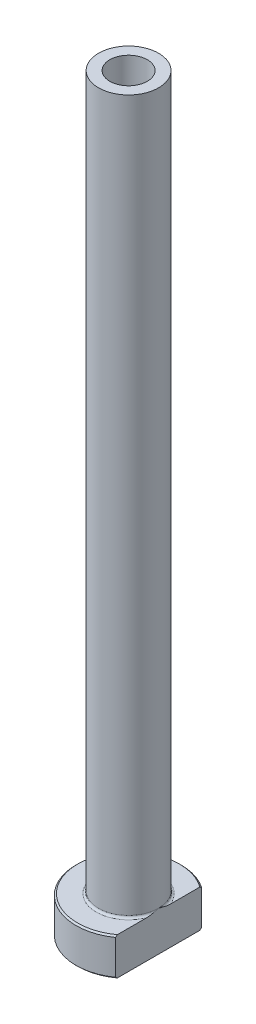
ISO-10303-21;
HEADER;
FILE_DESCRIPTION(('STEP AP214'),'2;1');
FILE_NAME('part.step','',(''),(''),'','','');
FILE_SCHEMA(('AUTOMOTIVE_DESIGN { 1 0 10303 214 1 1 1 1 }'));
ENDSEC;
DATA;
#1=APPLICATION_CONTEXT('core data for automotive mechanical design processes');
#2=APPLICATION_PROTOCOL_DEFINITION('international standard','automotive_design',2000,#1);
#3=PRODUCT_CONTEXT('',#1,'mechanical');
#4=PRODUCT('Part','Part','',(#3));
#5=PRODUCT_RELATED_PRODUCT_CATEGORY('part','',(#4));
#6=PRODUCT_DEFINITION_FORMATION('','',#4);
#7=PRODUCT_DEFINITION_CONTEXT('part definition',#1,'design');
#8=PRODUCT_DEFINITION('design','',#6,#7);
#9=PRODUCT_DEFINITION_SHAPE('','',#8);
#10=(LENGTH_UNIT() NAMED_UNIT(*) SI_UNIT(.MILLI.,.METRE.));
#11=(NAMED_UNIT(*) PLANE_ANGLE_UNIT() SI_UNIT($,.RADIAN.));
#12=(NAMED_UNIT(*) SI_UNIT($,.STERADIAN.) SOLID_ANGLE_UNIT());
#13=UNCERTAINTY_MEASURE_WITH_UNIT(LENGTH_MEASURE(1.E-05),#10,'distance_accuracy_value','');
#14=(GEOMETRIC_REPRESENTATION_CONTEXT(3) GLOBAL_UNCERTAINTY_ASSIGNED_CONTEXT((#13)) GLOBAL_UNIT_ASSIGNED_CONTEXT((#10,
#11,#12)) REPRESENTATION_CONTEXT('',''));
#15=CARTESIAN_POINT('',(0.,0.,0.));
#16=DIRECTION('',(0.,0.,1.));
#17=DIRECTION('',(1.,0.,0.));
#18=AXIS2_PLACEMENT_3D('',#15,#16,#17);
#19=CARTESIAN_POINT('',(0.,92.1876809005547,0.));
#20=DIRECTION('',(0.,1.,0.));
#21=DIRECTION('',(0.,0.,1.));
#22=AXIS2_PLACEMENT_3D('',#19,#20,#21);
#23=CYLINDRICAL_SURFACE('',#22,2.49999999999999);
#24=CARTESIAN_POINT('',(0.,100.,0.));
#25=DIRECTION('',(0.,1.,0.));
#26=DIRECTION('',(0.,0.,1.));
#27=AXIS2_PLACEMENT_3D('',#24,#25,#26);
#28=CIRCLE('',#27,2.49999999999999);
#29=CARTESIAN_POINT('',(0.,100.,2.49999999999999));
#30=VERTEX_POINT('',#29);
#31=EDGE_CURVE('E167',#30,#30,#28,.T.);
#32=ORIENTED_EDGE('',*,*,#31,.T.);
#33=EDGE_LOOP('',(#32));
#34=FACE_BOUND('',#33,.T.);
#35=CARTESIAN_POINT('',(0.,55.,0.));
#36=DIRECTION('',(0.,1.,0.));
#37=DIRECTION('',(0.,0.,1.));
#38=AXIS2_PLACEMENT_3D('',#35,#36,#37);
#39=CIRCLE('',#38,2.49999999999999);
#40=CARTESIAN_POINT('',(0.,55.,2.49999999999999));
#41=VERTEX_POINT('',#40);
#42=EDGE_CURVE('E170',#41,#41,#39,.T.);
#43=ORIENTED_EDGE('',*,*,#42,.F.);
#44=EDGE_LOOP('',(#43));
#45=FACE_BOUND('',#44,.T.);
#46=ADVANCED_FACE('F32',(#34,#45),#23,.F.);
#47=CARTESIAN_POINT('',(-2.49999999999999,100.,0.));
#48=DIRECTION('',(0.,1.,0.));
#49=DIRECTION('',(0.,0.,1.));
#50=AXIS2_PLACEMENT_3D('',#47,#48,#49);
#51=PLANE('',#50);
#52=CARTESIAN_POINT('',(0.,100.,0.));
#53=DIRECTION('',(0.,1.,0.));
#54=DIRECTION('',(0.,0.,1.));
#55=AXIS2_PLACEMENT_3D('',#52,#53,#54);
#56=CIRCLE('',#55,4.);
#57=CARTESIAN_POINT('',(0.,100.,4.));
#58=VERTEX_POINT('',#57);
#59=EDGE_CURVE('E174',#58,#58,#56,.T.);
#60=ORIENTED_EDGE('',*,*,#59,.T.);
#61=EDGE_LOOP('',(#60));
#62=FACE_BOUND('',#61,.T.);
#63=ORIENTED_EDGE('',*,*,#31,.F.);
#64=EDGE_LOOP('',(#63));
#65=FACE_BOUND('',#64,.T.);
#66=ADVANCED_FACE('F157',(#62,#65),#51,.T.);
#67=CARTESIAN_POINT('',(0.,92.1876809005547,0.));
#68=DIRECTION('',(0.,1.,0.));
#69=DIRECTION('',(0.,0.,1.));
#70=AXIS2_PLACEMENT_3D('',#67,#68,#69);
#71=CYLINDRICAL_SURFACE('',#70,4.);
#72=CARTESIAN_POINT('',(0.,5.3,0.));
#73=DIRECTION('',(0.,1.,0.));
#74=DIRECTION('',(0.,0.,1.));
#75=AXIS2_PLACEMENT_3D('',#72,#73,#74);
#76=CIRCLE('',#75,4.);
#77=CARTESIAN_POINT('',(4.,5.3,0.));
#78=VERTEX_POINT('',#77);
#79=EDGE_CURVE('E180',#78,#78,#76,.T.);
#80=ORIENTED_EDGE('',*,*,#79,.T.);
#81=EDGE_LOOP('',(#80));
#82=FACE_BOUND('',#81,.T.);
#83=ORIENTED_EDGE('',*,*,#59,.F.);
#84=EDGE_LOOP('',(#83));
#85=FACE_BOUND('',#84,.T.);
#86=ADVANCED_FACE('F162',(#82,#85),#71,.T.);
#87=CARTESIAN_POINT('',(-3.99999999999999,5.,0.));
#88=DIRECTION('',(0.,1.,0.));
#89=DIRECTION('',(0.,0.,1.));
#90=AXIS2_PLACEMENT_3D('',#87,#88,#89);
#91=PLANE('',#90);
#92=DIRECTION('',(0.,0.,1.));
#93=VECTOR('',#92,1.);
#94=CARTESIAN_POINT('',(4.,5.,0.));
#95=LINE('',#94,#93);
#96=CARTESIAN_POINT('',(4.,5.,-5.499090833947));
#97=VERTEX_POINT('',#96);
#98=CARTESIAN_POINT('',(4.,5.,-1.57797338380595));
#99=VERTEX_POINT('',#98);
#100=EDGE_CURVE('E54',#97,#99,#95,.T.);
#101=ORIENTED_EDGE('',*,*,#100,.F.);
#102=CARTESIAN_POINT('',(0.,5.,0.));
#103=DIRECTION('',(0.,1.,0.));
#104=DIRECTION('',(0.,0.,1.));
#105=AXIS2_PLACEMENT_3D('',#102,#103,#104);
#106=CIRCLE('',#105,6.79999999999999);
#107=CARTESIAN_POINT('',(3.99999999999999,5.,5.499090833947));
#108=VERTEX_POINT('',#107);
#109=EDGE_CURVE('E186',#97,#108,#106,.T.);
#110=ORIENTED_EDGE('',*,*,#109,.T.);
#111=CARTESIAN_POINT('',(4.,5.,1.57797338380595));
#112=VERTEX_POINT('',#111);
#113=EDGE_CURVE('E134',#112,#108,#95,.T.);
#114=ORIENTED_EDGE('',*,*,#113,.F.);
#115=CARTESIAN_POINT('',(0.,5.,0.));
#116=DIRECTION('',(0.,1.,0.));
#117=DIRECTION('',(0.,0.,1.));
#118=AXIS2_PLACEMENT_3D('',#115,#116,#117);
#119=CIRCLE('',#118,4.3);
#120=EDGE_CURVE('E183',#112,#99,#119,.F.);
#121=ORIENTED_EDGE('',*,*,#120,.T.);
#122=EDGE_LOOP('',(#101,#110,#114,#121));
#123=FACE_BOUND('',#122,.T.);
#124=ADVANCED_FACE('F197',(#123),#91,.T.);
#125=CARTESIAN_POINT('',(0.,92.1876809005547,0.));
#126=DIRECTION('',(0.,1.,0.));
#127=DIRECTION('',(0.,0.,1.));
#128=AXIS2_PLACEMENT_3D('',#125,#126,#127);
#129=CYLINDRICAL_SURFACE('',#128,6.99999999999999);
#130=DIRECTION('',(0.,-1.,0.));
#131=VECTOR('',#130,1.);
#132=CARTESIAN_POINT('',(3.99999999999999,100.,5.74456264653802));
#133=LINE('',#132,#131);
#134=CARTESIAN_POINT('',(3.99999999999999,4.8,5.74456264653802));
#135=VERTEX_POINT('',#134);
#136=CARTESIAN_POINT('',(3.99999999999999,0.199999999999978,5.74456264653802));
#137=VERTEX_POINT('',#136);
#138=EDGE_CURVE('E82',#135,#137,#133,.T.);
#139=ORIENTED_EDGE('',*,*,#138,.F.);
#140=CARTESIAN_POINT('',(0.,4.8,0.));
#141=DIRECTION('',(0.,1.,0.));
#142=DIRECTION('',(0.,0.,1.));
#143=AXIS2_PLACEMENT_3D('',#140,#141,#142);
#144=CIRCLE('',#143,6.99999999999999);
#145=CARTESIAN_POINT('',(4.,4.8,-5.74456264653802));
#146=VERTEX_POINT('',#145);
#147=EDGE_CURVE('E95',#135,#146,#144,.F.);
#148=ORIENTED_EDGE('',*,*,#147,.T.);
#149=DIRECTION('',(0.,-1.,0.));
#150=VECTOR('',#149,1.);
#151=CARTESIAN_POINT('',(4.,100.,-5.74456264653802));
#152=LINE('',#151,#150);
#153=CARTESIAN_POINT('',(4.,0.199999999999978,-5.74456264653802));
#154=VERTEX_POINT('',#153);
#155=EDGE_CURVE('E192',#146,#154,#152,.T.);
#156=ORIENTED_EDGE('',*,*,#155,.T.);
#157=CARTESIAN_POINT('',(0.,0.199999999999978,0.));
#158=DIRECTION('',(0.,-1.,0.));
#159=DIRECTION('',(0.,0.,-1.));
#160=AXIS2_PLACEMENT_3D('',#157,#158,#159);
#161=CIRCLE('',#160,6.99999999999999);
#162=EDGE_CURVE('E98',#154,#137,#161,.F.);
#163=ORIENTED_EDGE('',*,*,#162,.T.);
#164=EDGE_LOOP('',(#139,#148,#156,#163));
#165=FACE_BOUND('',#164,.T.);
#166=ADVANCED_FACE('F190',(#165),#129,.T.);
#167=CARTESIAN_POINT('',(-6.99999999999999,0.,0.));
#168=DIRECTION('',(0.,-1.,0.));
#169=DIRECTION('',(0.,0.,-1.));
#170=AXIS2_PLACEMENT_3D('',#167,#168,#169);
#171=PLANE('',#170);
#172=CARTESIAN_POINT('',(0.,0.,0.));
#173=DIRECTION('',(0.,-1.,0.));
#174=DIRECTION('',(0.,0.,-1.));
#175=AXIS2_PLACEMENT_3D('',#172,#173,#174);
#176=CIRCLE('',#175,3.24999999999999);
#177=CARTESIAN_POINT('',(0.,0.,-3.24999999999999));
#178=VERTEX_POINT('',#177);
#179=EDGE_CURVE('E40',#178,#178,#176,.F.);
#180=ORIENTED_EDGE('',*,*,#179,.T.);
#181=EDGE_LOOP('',(#180));
#182=FACE_BOUND('',#181,.T.);
#183=DIRECTION('',(0.,0.,-1.));
#184=VECTOR('',#183,1.);
#185=CARTESIAN_POINT('',(3.99999999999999,0.,5.74456264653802));
#186=LINE('',#185,#184);
#187=CARTESIAN_POINT('',(3.99999999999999,0.,5.49909083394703));
#188=VERTEX_POINT('',#187);
#189=CARTESIAN_POINT('',(4.,0.,-5.49909083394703));
#190=VERTEX_POINT('',#189);
#191=EDGE_CURVE('E47',#188,#190,#186,.T.);
#192=ORIENTED_EDGE('',*,*,#191,.F.);
#193=CARTESIAN_POINT('',(0.,0.,0.));
#194=DIRECTION('',(0.,-1.,0.));
#195=DIRECTION('',(0.,0.,-1.));
#196=AXIS2_PLACEMENT_3D('',#193,#194,#195);
#197=CIRCLE('',#196,6.80000000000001);
#198=EDGE_CURVE('E92',#188,#190,#197,.T.);
#199=ORIENTED_EDGE('',*,*,#198,.T.);
#200=EDGE_LOOP('',(#192,#199));
#201=FACE_BOUND('',#200,.T.);
#202=ADVANCED_FACE('F91',(#182,#201),#171,.T.);
#203=CARTESIAN_POINT('',(0.,92.1876809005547,0.));
#204=DIRECTION('',(0.,1.,0.));
#205=DIRECTION('',(0.,0.,1.));
#206=AXIS2_PLACEMENT_3D('',#203,#204,#205);
#207=CYLINDRICAL_SURFACE('',#206,2.74999999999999);
#208=CARTESIAN_POINT('',(0.,0.5,0.));
#209=DIRECTION('',(0.,-1.,0.));
#210=DIRECTION('',(0.,0.,-1.));
#211=AXIS2_PLACEMENT_3D('',#208,#209,#210);
#212=CIRCLE('',#211,2.74999999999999);
#213=CARTESIAN_POINT('',(0.,0.5,-2.74999999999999));
#214=VERTEX_POINT('',#213);
#215=EDGE_CURVE('E11',#214,#214,#212,.T.);
#216=ORIENTED_EDGE('',*,*,#215,.T.);
#217=EDGE_LOOP('',(#216));
#218=FACE_BOUND('',#217,.T.);
#219=CARTESIAN_POINT('',(0.,43.,0.));
#220=DIRECTION('',(0.,1.,0.));
#221=DIRECTION('',(0.,0.,1.));
#222=AXIS2_PLACEMENT_3D('',#219,#220,#221);
#223=CIRCLE('',#222,2.75);
#224=CARTESIAN_POINT('',(0.,43.,2.75));
#225=VERTEX_POINT('',#224);
#226=EDGE_CURVE('E172',#225,#225,#223,.T.);
#227=ORIENTED_EDGE('',*,*,#226,.T.);
#228=EDGE_LOOP('',(#227));
#229=FACE_BOUND('',#228,.T.);
#230=ADVANCED_FACE('F215',(#218,#229),#207,.F.);
#231=CARTESIAN_POINT('',(0.,43.,0.));
#232=DIRECTION('',(0.,-1.,0.));
#233=DIRECTION('',(0.,0.,-1.));
#234=AXIS2_PLACEMENT_3D('',#231,#232,#233);
#235=CONICAL_SURFACE('',#234,2.75,0.0208303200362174);
#236=ORIENTED_EDGE('',*,*,#42,.T.);
#237=EDGE_LOOP('',(#236));
#238=FACE_BOUND('',#237,.T.);
#239=ORIENTED_EDGE('',*,*,#226,.F.);
#240=EDGE_LOOP('',(#239));
#241=FACE_BOUND('',#240,.T.);
#242=ADVANCED_FACE('F111',(#238,#241),#235,.F.);
#243=CARTESIAN_POINT('',(0.,5.3,0.));
#244=DIRECTION('',(0.,1.,0.));
#245=DIRECTION('',(0.,0.,1.));
#246=AXIS2_PLACEMENT_3D('',#243,#244,#245);
#247=TOROIDAL_SURFACE('',#246,4.3,0.3);
#248=ORIENTED_EDGE('',*,*,#120,.F.);
#249=CARTESIAN_POINT('',(4.,5.3,0.));
#250=CARTESIAN_POINT('',(4.,5.30000062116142,-1.06250722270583E-10));
#251=CARTESIAN_POINT('',(4.,5.30000124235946,2.17726018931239E-07));
#252=CARTESIAN_POINT('',(4.,5.30000240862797,8.3614089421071E-07));
#253=CARTESIAN_POINT('',(4.,5.30000294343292,1.25011668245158E-06));
#254=CARTESIAN_POINT('',(4.,5.30000404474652,2.2395931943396E-06));
#255=CARTESIAN_POINT('',(4.,5.30000459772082,2.83084440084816E-06));
#256=CARTESIAN_POINT('',(4.,5.30000559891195,4.06516578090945E-06));
#257=CARTESIAN_POINT('',(4.,5.30000604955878,4.70640059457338E-06));
#258=CARTESIAN_POINT('',(4.,5.30000769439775,7.15677166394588E-06));
#259=CARTESIAN_POINT('',(4.,5.30000879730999,9.02995921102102E-06));
#260=CARTESIAN_POINT('',(4.,5.30001063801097,1.27664881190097E-05));
#261=CARTESIAN_POINT('',(4.,5.30001139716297,1.46197801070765E-05));
#262=CARTESIAN_POINT('',(4.,5.30001453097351,2.23679212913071E-05));
#263=CARTESIAN_POINT('',(4.,5.30001683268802,2.82968736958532E-05));
#264=CARTESIAN_POINT('',(4.,5.30002027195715,3.95668715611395E-05));
#265=CARTESIAN_POINT('',(4.,5.30002152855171,4.48715448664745E-05));
#266=CARTESIAN_POINT('',(4.,5.30003060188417,8.40118178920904E-05));
#267=CARTESIAN_POINT('',(4.,5.30003739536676,0.000118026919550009));
#268=CARTESIAN_POINT('',(4.,5.30006713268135,0.000252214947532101));
#269=CARTESIAN_POINT('',(4.,5.30009559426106,0.000351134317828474));
#270=CARTESIAN_POINT('',(4.,5.3002062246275,0.00074247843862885));
#271=CARTESIAN_POINT('',(4.,5.30028475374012,0.00103561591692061));
#272=CARTESIAN_POINT('',(4.,5.30059889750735,0.0021992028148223));
#273=CARTESIAN_POINT('',(4.,5.30083905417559,0.00306873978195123));
#274=CARTESIAN_POINT('',(4.,5.3018368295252,0.00669141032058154));
#275=CARTESIAN_POINT('',(4.,5.30258877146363,0.00944568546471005));
#276=CARTESIAN_POINT('',(4.,5.31066890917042,0.039029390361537));
#277=CARTESIAN_POINT('',(4.,5.31802631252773,0.0658531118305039));
#278=CARTESIAN_POINT('',(4.,5.33239676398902,0.118441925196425));
#279=CARTESIAN_POINT('',(4.,5.33941183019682,0.144206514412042));
#280=CARTESIAN_POINT('',(4.,5.35427366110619,0.199017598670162));
#281=CARTESIAN_POINT('',(4.,5.36211313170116,0.228066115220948));
#282=CARTESIAN_POINT('',(4.,5.37776349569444,0.286511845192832));
#283=CARTESIAN_POINT('',(4.,5.38557313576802,0.31590939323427));
#284=CARTESIAN_POINT('',(4.,5.40425662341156,0.386994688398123));
#285=CARTESIAN_POINT('',(4.,5.41505237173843,0.428703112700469));
#286=CARTESIAN_POINT('',(4.,5.43592310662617,0.511098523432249));
#287=CARTESIAN_POINT('',(4.,5.44600969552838,0.551782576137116));
#288=CARTESIAN_POINT('',(4.,5.4785098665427,0.686599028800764));
#289=CARTESIAN_POINT('',(4.,5.4997837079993,0.781011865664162));
#290=CARTESIAN_POINT('',(4.,5.53807543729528,0.971847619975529));
#291=CARTESIAN_POINT('',(4.,5.55504273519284,1.06828120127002));
#292=CARTESIAN_POINT('',(4.,5.57582405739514,1.21752725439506));
#293=CARTESIAN_POINT('',(4.,5.58209796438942,1.26999379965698));
#294=CARTESIAN_POINT('',(4.,5.59210686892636,1.37516324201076));
#295=CARTESIAN_POINT('',(4.,5.59584265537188,1.42786606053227));
#296=CARTESIAN_POINT('',(4.,5.60010438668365,1.53310673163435));
#297=CARTESIAN_POINT('',(4.,5.6006487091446,1.5856437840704));
#298=CARTESIAN_POINT('',(4.,5.59767158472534,1.69058605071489));
#299=CARTESIAN_POINT('',(4.,5.59415502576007,1.74299134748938));
#300=CARTESIAN_POINT('',(4.,5.58503062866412,1.81903290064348));
#301=CARTESIAN_POINT('',(4.,5.58157617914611,1.84292934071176));
#302=CARTESIAN_POINT('',(4.,5.57329952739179,1.89051061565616));
#303=CARTESIAN_POINT('',(4.,5.56847619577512,1.91419525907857));
#304=CARTESIAN_POINT('',(4.,5.55726644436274,1.96092888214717));
#305=CARTESIAN_POINT('',(4.,5.55089740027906,1.98398195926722));
#306=CARTESIAN_POINT('',(4.,5.53623434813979,2.02945550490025));
#307=CARTESIAN_POINT('',(4.,5.52794253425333,2.05187666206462));
#308=CARTESIAN_POINT('',(4.,5.50887098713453,2.09590631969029));
#309=CARTESIAN_POINT('',(4.,5.49806837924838,2.11750508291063));
#310=CARTESIAN_POINT('',(4.,5.47333401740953,2.15885583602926));
#311=CARTESIAN_POINT('',(4.,5.45941272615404,2.17861369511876));
#312=CARTESIAN_POINT('',(4.,5.43588221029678,2.20522942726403));
#313=CARTESIAN_POINT('',(4.,5.42781139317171,2.2134404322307));
#314=CARTESIAN_POINT('',(4.,5.41065114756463,2.2287514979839));
#315=CARTESIAN_POINT('',(4.,5.40156129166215,2.23585108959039));
#316=CARTESIAN_POINT('',(4.,5.38220524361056,2.2485969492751));
#317=CARTESIAN_POINT('',(4.,5.37192420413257,2.25422119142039));
#318=CARTESIAN_POINT('',(4.,5.35045072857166,2.2633106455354));
#319=CARTESIAN_POINT('',(4.,5.33926122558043,2.26678251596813));
#320=CARTESIAN_POINT('',(4.,5.31952044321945,2.27051268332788));
#321=CARTESIAN_POINT('',(4.,5.3110845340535,2.27139016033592));
#322=CARTESIAN_POINT('',(4.,5.29418624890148,2.2716896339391));
#323=CARTESIAN_POINT('',(4.,5.28572387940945,2.27111196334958));
#324=CARTESIAN_POINT('',(4.,5.26904138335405,2.26855580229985));
#325=CARTESIAN_POINT('',(4.,5.26082066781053,2.26658107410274));
#326=CARTESIAN_POINT('',(4.,5.24478214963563,2.26139496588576));
#327=CARTESIAN_POINT('',(4.,5.23696461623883,2.25818277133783));
#328=CARTESIAN_POINT('',(4.,5.21851235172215,2.24908332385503));
#329=CARTESIAN_POINT('',(4.,5.20815219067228,2.24264095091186));
#330=CARTESIAN_POINT('',(4.,5.18857975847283,2.22819957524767));
#331=CARTESIAN_POINT('',(4.,5.17937061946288,2.2201964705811));
#332=CARTESIAN_POINT('',(4.,5.15665383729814,2.19777756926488));
#333=CARTESIAN_POINT('',(4.,5.14403484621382,2.18246908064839));
#334=CARTESIAN_POINT('',(4.,5.12118369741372,2.15020843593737));
#335=CARTESIAN_POINT('',(4.,5.11095480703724,2.13325407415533));
#336=CARTESIAN_POINT('',(4.,5.09273574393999,2.09892324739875));
#337=CARTESIAN_POINT('',(4.,5.08468212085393,2.08157988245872));
#338=CARTESIAN_POINT('',(4.,5.07005901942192,2.04627072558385));
#339=CARTESIAN_POINT('',(4.,5.06349101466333,2.02830433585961));
#340=CARTESIAN_POINT('',(4.,5.04555485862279,1.97350761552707));
#341=CARTESIAN_POINT('',(4.,5.03608974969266,1.93605770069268));
#342=CARTESIAN_POINT('',(4.,5.01780569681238,1.84529235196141));
#343=CARTESIAN_POINT('',(4.,5.01077018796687,1.79164082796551));
#344=CARTESIAN_POINT('',(4.,5.00182846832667,1.68379947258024));
#345=CARTESIAN_POINT('',(4.,4.99993887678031,1.62960846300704));
#346=CARTESIAN_POINT('',(4.,5.00006129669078,1.52361204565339));
#347=CARTESIAN_POINT('',(4.,5.0019069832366,1.47180551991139));
#348=CARTESIAN_POINT('',(4.,5.0084124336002,1.36835357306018));
#349=CARTESIAN_POINT('',(4.,5.01307376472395,1.31670825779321));
#350=CARTESIAN_POINT('',(4.,5.02905484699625,1.17431887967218));
#351=CARTESIAN_POINT('',(4.,5.04274090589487,1.08384207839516));
#352=CARTESIAN_POINT('',(4.,5.06701714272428,0.947757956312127));
#353=CARTESIAN_POINT('',(4.,5.07585573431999,0.901814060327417));
#354=CARTESIAN_POINT('',(4.,5.09458665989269,0.810008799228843));
#355=CARTESIAN_POINT('',(4.,5.1044818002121,0.764148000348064));
#356=CARTESIAN_POINT('',(4.,5.12892434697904,0.655631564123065));
#357=CARTESIAN_POINT('',(4.,5.14383556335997,0.593058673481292));
#358=CARTESIAN_POINT('',(4.,5.17458762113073,0.468885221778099));
#359=CARTESIAN_POINT('',(4.,5.19041623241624,0.407281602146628));
#360=CARTESIAN_POINT('',(4.,5.22090834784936,0.29123270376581));
#361=CARTESIAN_POINT('',(4.,5.23550024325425,0.236768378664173));
#362=CARTESIAN_POINT('',(4.,5.26562550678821,0.125604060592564));
#363=CARTESIAN_POINT('',(4.,5.28117250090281,0.0689076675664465));
#364=CARTESIAN_POINT('',(4.,5.29741226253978,0.0094415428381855));
#365=CARTESIAN_POINT('',(4.,5.29816540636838,0.00668315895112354));
#366=CARTESIAN_POINT('',(4.,5.29916346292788,0.00305954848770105));
#367=CARTESIAN_POINT('',(4.,5.29940273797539,0.00219318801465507));
#368=CARTESIAN_POINT('',(4.,5.2997158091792,0.00103357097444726));
#369=CARTESIAN_POINT('',(4.,5.29979412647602,0.00074122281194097));
#370=CARTESIAN_POINT('',(4.,5.29990450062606,0.000350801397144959));
#371=CARTESIAN_POINT('',(4.,5.29993292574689,0.000252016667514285));
#372=CARTESIAN_POINT('',(4.,5.29996263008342,0.000117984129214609));
#373=CARTESIAN_POINT('',(4.,5.29996941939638,8.39881862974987E-05));
#374=CARTESIAN_POINT('',(4.,5.29997848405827,4.48673992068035E-05));
#375=CARTESIAN_POINT('',(4.,5.29997973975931,3.95638164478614E-05));
#376=CARTESIAN_POINT('',(4.,5.29998317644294,2.8296031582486E-05));
#377=CARTESIAN_POINT('',(4.,5.2999854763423,2.23681438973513E-05));
#378=CARTESIAN_POINT('',(4.,5.29998860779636,1.46210990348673E-05));
#379=CARTESIAN_POINT('',(4.,5.29998936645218,1.27678887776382E-05));
#380=CARTESIAN_POINT('',(4.,5.29999120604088,9.03143944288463E-06));
#381=CARTESIAN_POINT('',(4.,5.29999230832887,7.15824000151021E-06));
#382=CARTESIAN_POINT('',(4.,5.29999395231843,4.70775467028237E-06));
#383=CARTESIAN_POINT('',(4.,5.29999440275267,4.06646329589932E-06));
#384=CARTESIAN_POINT('',(4.,5.29999540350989,2.83199042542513E-06));
#385=CARTESIAN_POINT('',(4.,5.29999595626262,2.24064306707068E-06));
#386=CARTESIAN_POINT('',(4.,5.29999705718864,1.25093947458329E-06));
#387=CARTESIAN_POINT('',(4.,5.2999975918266,8.36840866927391E-07));
#388=CARTESIAN_POINT('',(4.,5.29999875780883,2.18117657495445E-07));
#389=CARTESIAN_POINT('',(4.,5.29999937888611,1.06243800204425E-10));
#390=CARTESIAN_POINT('',(4.,5.3,0.));
#391=B_SPLINE_CURVE_WITH_KNOTS('',3,(#249,#250,#251,#252,#253,#254,#255,#256,#257,#258,#259,
#260,#261,#262,#263,#264,#265,#266,#267,#268,#269,#270,#271,#272,#273,#274,#275,#276,#277,#278,
#279,#280,#281,#282,#283,#284,#285,#286,#287,#288,#289,#290,#291,#292,#293,#294,#295,#296,#297,
#298,#299,#300,#301,#302,#303,#304,#305,#306,#307,#308,#309,#310,#311,#312,#313,#314,#315,#316,
#317,#318,#319,#320,#321,#322,#323,#324,#325,#326,#327,#328,#329,#330,#331,#332,#333,#334,#335,
#336,#337,#338,#339,#340,#341,#342,#343,#344,#345,#346,#347,#348,#349,#350,#351,#352,#353,#354,
#355,#356,#357,#358,#359,#360,#361,#362,#363,#364,#365,#366,#367,#368,#369,#370,#371,#372,#373,
#374,#375,#376,#377,#378,#379,#380,#381,#382,#383,#384,#385,#386,#387,#388,#389,#390),
.UNSPECIFIED.,.T.,.F.,(4,2,2,2,2,2,2,2,2,2,2,2,2,2,2,2,2,2,2,2,2,2,2,2,2,2,2,2,2,2,2,2,2,2,2,2,
2,2,2,2,2,2,2,2,2,2,2,2,2,2,2,2,2,2,2,2,2,2,2,2,2,2,2,2,2,2,2,2,2,2,4),(0.,1.87484528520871E-06,
3.90180232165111E-06,6.31684114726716E-06,8.6665232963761E-06,1.51627596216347E-05,
2.11657986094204E-05,4.02090827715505E-05,5.65429538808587E-05,0.00016062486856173,
0.000469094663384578,0.001379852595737,0.00408571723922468,0.0126514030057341,
0.0960918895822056,0.176200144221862,0.266463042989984,0.357714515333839,0.486961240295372,
0.612707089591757,0.902988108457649,1.19653589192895,1.35501075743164,1.51343634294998,
1.67094875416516,1.82827177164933,1.90067591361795,1.97313996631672,2.04482437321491,
2.11642737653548,2.18871023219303,2.26075412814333,2.29521947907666,2.32969934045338,
2.36466792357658,2.39952778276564,2.42485422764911,2.45017488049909,2.47542760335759,
2.50069697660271,2.53708899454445,2.57357798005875,2.63276032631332,2.6920231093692,
2.749303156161,2.80663977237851,2.92223125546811,3.08420752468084,3.24670629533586,
3.40212850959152,3.55763731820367,3.83192962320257,3.97228382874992,4.11302057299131,
4.30598130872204,4.49678885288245,4.66594443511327,4.84230602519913,4.85088453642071,
4.8535805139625,4.8544888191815,4.85479687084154,4.85490089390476,4.85491722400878,
4.85493626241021,4.85494226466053,4.85494875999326,4.85495110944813,4.85495352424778,
4.85495555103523,4.85495742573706),.UNSPECIFIED.);
#392=EDGE_CURVE('E126',#112,#78,#391,.T.);
#393=ORIENTED_EDGE('',*,*,#392,.T.);
#394=ORIENTED_EDGE('',*,*,#79,.F.);
#395=CARTESIAN_POINT('',(4.,5.3,0.));
#396=CARTESIAN_POINT('',(4.,5.29999937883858,1.06251755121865E-10));
#397=CARTESIAN_POINT('',(4.,5.29999875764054,-2.17726017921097E-07));
#398=CARTESIAN_POINT('',(4.,5.29999759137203,-8.36140893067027E-07));
#399=CARTESIAN_POINT('',(4.,5.29999705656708,-1.25011668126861E-06));
#400=CARTESIAN_POINT('',(4.,5.29999595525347,-2.23959319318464E-06));
#401=CARTESIAN_POINT('',(4.,5.29999540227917,-2.83084439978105E-06));
#402=CARTESIAN_POINT('',(4.,5.29999440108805,-4.06516577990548E-06));
#403=CARTESIAN_POINT('',(4.,5.29999395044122,-4.706400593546E-06));
#404=CARTESIAN_POINT('',(4.,5.29999230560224,-7.15677166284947E-06));
#405=CARTESIAN_POINT('',(3.99999999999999,5.29999120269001,-9.02995920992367E-06));
#406=CARTESIAN_POINT('',(3.99999999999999,5.29998936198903,-1.2766488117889E-05));
#407=CARTESIAN_POINT('',(4.,5.29998860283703,-1.46197801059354E-05));
#408=CARTESIAN_POINT('',(4.,5.29998546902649,-2.23679212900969E-05));
#409=CARTESIAN_POINT('',(4.,5.29998316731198,-2.82968736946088E-05));
#410=CARTESIAN_POINT('',(4.,5.29997972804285,-3.95668715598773E-05));
#411=CARTESIAN_POINT('',(4.,5.29997847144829,-4.48715448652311E-05));
#412=CARTESIAN_POINT('',(4.,5.29996939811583,-8.40118178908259E-05));
#413=CARTESIAN_POINT('',(4.,5.29996260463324,-0.000118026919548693));
#414=CARTESIAN_POINT('',(3.99999999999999,5.29993286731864,-0.000252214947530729));
#415=CARTESIAN_POINT('',(4.,5.29990440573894,-0.000351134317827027));
#416=CARTESIAN_POINT('',(4.,5.2997937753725,-0.000742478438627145));
#417=CARTESIAN_POINT('',(4.,5.29971524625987,-0.00103561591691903));
#418=CARTESIAN_POINT('',(3.99999999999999,5.29940110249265,-0.00219920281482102));
#419=CARTESIAN_POINT('',(3.99999999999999,5.29916094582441,-0.00306873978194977));
#420=CARTESIAN_POINT('',(4.,5.2981631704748,-0.00669141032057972));
#421=CARTESIAN_POINT('',(4.,5.29741122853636,-0.0094456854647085));
#422=CARTESIAN_POINT('',(3.99999999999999,5.28933109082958,-0.039029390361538));
#423=CARTESIAN_POINT('',(3.99999999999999,5.28197368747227,-0.0658531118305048));
#424=CARTESIAN_POINT('',(4.,5.26760323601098,-0.118441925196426));
#425=CARTESIAN_POINT('',(4.,5.26058816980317,-0.144206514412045));
#426=CARTESIAN_POINT('',(3.99999999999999,5.24572633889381,-0.199017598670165));
#427=CARTESIAN_POINT('',(4.,5.23788686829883,-0.22806611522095));
#428=CARTESIAN_POINT('',(4.,5.22223650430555,-0.286511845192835));
#429=CARTESIAN_POINT('',(4.,5.21442686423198,-0.315909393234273));
#430=CARTESIAN_POINT('',(4.,5.19574337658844,-0.386994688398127));
#431=CARTESIAN_POINT('',(4.,5.18494762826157,-0.428703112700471));
#432=CARTESIAN_POINT('',(4.,5.16407689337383,-0.511098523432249));
#433=CARTESIAN_POINT('',(4.,5.15399030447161,-0.551782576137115));
#434=CARTESIAN_POINT('',(4.,5.12149013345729,-0.686599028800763));
#435=CARTESIAN_POINT('',(4.,5.1002162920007,-0.781011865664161));
#436=CARTESIAN_POINT('',(4.,5.06192456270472,-0.971847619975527));
#437=CARTESIAN_POINT('',(4.,5.04495726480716,-1.06828120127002));
#438=CARTESIAN_POINT('',(4.,5.02417594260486,-1.21752725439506));
#439=CARTESIAN_POINT('',(4.,5.01790203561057,-1.26999379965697));
#440=CARTESIAN_POINT('',(4.,5.00789313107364,-1.37516324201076));
#441=CARTESIAN_POINT('',(4.,5.00415734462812,-1.42786606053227));
#442=CARTESIAN_POINT('',(4.,4.99989561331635,-1.53310673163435));
#443=CARTESIAN_POINT('',(4.,4.9993512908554,-1.5856437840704));
#444=CARTESIAN_POINT('',(4.,5.00232841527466,-1.69058605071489));
#445=CARTESIAN_POINT('',(4.,5.00584497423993,-1.74299134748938));
#446=CARTESIAN_POINT('',(4.,5.01496937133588,-1.81903290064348));
#447=CARTESIAN_POINT('',(4.,5.01842382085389,-1.84292934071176));
#448=CARTESIAN_POINT('',(4.,5.02670047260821,-1.89051061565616));
#449=CARTESIAN_POINT('',(4.,5.03152380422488,-1.91419525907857));
#450=CARTESIAN_POINT('',(4.,5.04273355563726,-1.96092888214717));
#451=CARTESIAN_POINT('',(4.,5.04910259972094,-1.98398195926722));
#452=CARTESIAN_POINT('',(4.,5.0637656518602,-2.02945550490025));
#453=CARTESIAN_POINT('',(4.,5.07205746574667,-2.05187666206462));
#454=CARTESIAN_POINT('',(4.,5.09112901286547,-2.09590631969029));
#455=CARTESIAN_POINT('',(4.,5.10193162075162,-2.11750508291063));
#456=CARTESIAN_POINT('',(4.,5.12666598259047,-2.15885583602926));
#457=CARTESIAN_POINT('',(4.,5.14058727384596,-2.17861369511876));
#458=CARTESIAN_POINT('',(4.,5.16411778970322,-2.20522942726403));
#459=CARTESIAN_POINT('',(4.,5.17218860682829,-2.2134404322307));
#460=CARTESIAN_POINT('',(4.,5.18934885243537,-2.2287514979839));
#461=CARTESIAN_POINT('',(4.,5.19843870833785,-2.23585108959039));
#462=CARTESIAN_POINT('',(4.,5.21779475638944,-2.2485969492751));
#463=CARTESIAN_POINT('',(4.,5.22807579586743,-2.25422119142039));
#464=CARTESIAN_POINT('',(4.,5.24954927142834,-2.2633106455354));
#465=CARTESIAN_POINT('',(4.,5.26073877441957,-2.26678251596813));
#466=CARTESIAN_POINT('',(4.,5.28047955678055,-2.27051268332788));
#467=CARTESIAN_POINT('',(4.,5.2889154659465,-2.27139016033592));
#468=CARTESIAN_POINT('',(4.,5.30581375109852,-2.2716896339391));
#469=CARTESIAN_POINT('',(4.,5.31427612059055,-2.27111196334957));
#470=CARTESIAN_POINT('',(4.,5.33095861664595,-2.26855580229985));
#471=CARTESIAN_POINT('',(4.,5.33917933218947,-2.26658107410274));
#472=CARTESIAN_POINT('',(4.,5.35521785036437,-2.26139496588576));
#473=CARTESIAN_POINT('',(4.,5.36303538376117,-2.25818277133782));
#474=CARTESIAN_POINT('',(4.,5.38148764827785,-2.24908332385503));
#475=CARTESIAN_POINT('',(4.,5.39184780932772,-2.24264095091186));
#476=CARTESIAN_POINT('',(4.,5.41142024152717,-2.22819957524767));
#477=CARTESIAN_POINT('',(4.,5.42062938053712,-2.2201964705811));
#478=CARTESIAN_POINT('',(4.,5.44334616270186,-2.19777756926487));
#479=CARTESIAN_POINT('',(4.,5.45596515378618,-2.18246908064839));
#480=CARTESIAN_POINT('',(4.,5.47881630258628,-2.15020843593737));
#481=CARTESIAN_POINT('',(4.,5.48904519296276,-2.13325407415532));
#482=CARTESIAN_POINT('',(4.,5.50726425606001,-2.09892324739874));
#483=CARTESIAN_POINT('',(4.,5.51531787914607,-2.08157988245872));
#484=CARTESIAN_POINT('',(4.,5.52994098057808,-2.04627072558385));
#485=CARTESIAN_POINT('',(4.,5.53650898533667,-2.02830433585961));
#486=CARTESIAN_POINT('',(4.,5.55444514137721,-1.97350761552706));
#487=CARTESIAN_POINT('',(4.,5.56391025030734,-1.93605770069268));
#488=CARTESIAN_POINT('',(4.,5.58219430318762,-1.8452923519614));
#489=CARTESIAN_POINT('',(4.,5.58922981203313,-1.79164082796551));
#490=CARTESIAN_POINT('',(4.,5.59817153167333,-1.68379947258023));
#491=CARTESIAN_POINT('',(4.,5.60006112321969,-1.62960846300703));
#492=CARTESIAN_POINT('',(4.,5.59993870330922,-1.52361204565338));
#493=CARTESIAN_POINT('',(4.,5.5980930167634,-1.47180551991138));
#494=CARTESIAN_POINT('',(4.,5.5915875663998,-1.36835357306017));
#495=CARTESIAN_POINT('',(4.,5.58692623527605,-1.31670825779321));
#496=CARTESIAN_POINT('',(4.,5.57094515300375,-1.17431887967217));
#497=CARTESIAN_POINT('',(4.,5.55725909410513,-1.08384207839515));
#498=CARTESIAN_POINT('',(4.,5.53298285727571,-0.947757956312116));
#499=CARTESIAN_POINT('',(4.,5.52414426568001,-0.901814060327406));
#500=CARTESIAN_POINT('',(4.,5.5054133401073,-0.810008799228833));
#501=CARTESIAN_POINT('',(4.,5.4955181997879,-0.764148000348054));
#502=CARTESIAN_POINT('',(4.,5.47107565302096,-0.655631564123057));
#503=CARTESIAN_POINT('',(4.,5.45616443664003,-0.593058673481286));
#504=CARTESIAN_POINT('',(4.,5.42541237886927,-0.468885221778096));
#505=CARTESIAN_POINT('',(3.99999999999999,5.40958376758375,-0.407281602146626));
#506=CARTESIAN_POINT('',(4.,5.37909165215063,-0.291232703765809));
#507=CARTESIAN_POINT('',(4.,5.36449975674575,-0.236768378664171));
#508=CARTESIAN_POINT('',(3.99999999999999,5.33437449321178,-0.125604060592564));
#509=CARTESIAN_POINT('',(3.99999999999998,5.31882749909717,-0.0689076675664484));
#510=CARTESIAN_POINT('',(4.,5.30258773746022,-0.00944154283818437));
#511=CARTESIAN_POINT('',(4.,5.30183459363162,-0.00668315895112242));
#512=CARTESIAN_POINT('',(3.99999999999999,5.30083653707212,-0.00305954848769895));
#513=CARTESIAN_POINT('',(3.99999999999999,5.30059726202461,-0.00219318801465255));
#514=CARTESIAN_POINT('',(4.,5.30028419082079,-0.00103357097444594));
#515=CARTESIAN_POINT('',(4.,5.30020587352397,-0.000741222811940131));
#516=CARTESIAN_POINT('',(4.,5.30009549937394,-0.000350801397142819));
#517=CARTESIAN_POINT('',(3.99999999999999,5.30006707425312,-0.000252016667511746));
#518=CARTESIAN_POINT('',(4.,5.30003736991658,-0.000117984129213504));
#519=CARTESIAN_POINT('',(4.,5.30003058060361,-8.39881862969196E-05));
#520=CARTESIAN_POINT('',(4.,5.30002151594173,-4.48673992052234E-05));
#521=CARTESIAN_POINT('',(4.,5.30002026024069,-3.95638164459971E-05));
#522=CARTESIAN_POINT('',(4.,5.30001682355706,-2.82960315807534E-05));
#523=CARTESIAN_POINT('',(4.,5.3000145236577,-2.23681438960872E-05));
#524=CARTESIAN_POINT('',(4.,5.30001139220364,-1.46210990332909E-05));
#525=CARTESIAN_POINT('',(3.99999999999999,5.30001063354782,-1.27678887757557E-05));
#526=CARTESIAN_POINT('',(3.99999999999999,5.30000879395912,-9.03143944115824E-06));
#527=CARTESIAN_POINT('',(4.,5.30000769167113,-7.15824000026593E-06));
#528=CARTESIAN_POINT('',(4.,5.30000604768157,-4.70775466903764E-06));
#529=CARTESIAN_POINT('',(4.,5.30000559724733,-4.0664632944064E-06));
#530=CARTESIAN_POINT('',(4.,5.30000459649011,-2.83199042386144E-06));
#531=CARTESIAN_POINT('',(4.,5.30000404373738,-2.24064306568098E-06));
#532=CARTESIAN_POINT('',(4.,5.30000294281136,-1.25093947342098E-06));
#533=CARTESIAN_POINT('',(4.,5.30000240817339,-8.36840865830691E-07));
#534=CARTESIAN_POINT('',(4.,5.30000124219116,-2.18117656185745E-07));
#535=CARTESIAN_POINT('',(4.,5.30000062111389,-1.06242417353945E-10));
#536=CARTESIAN_POINT('',(4.,5.3,0.));
#537=B_SPLINE_CURVE_WITH_KNOTS('',3,(#395,#396,#397,#398,#399,#400,#401,#402,#403,#404,#405,
#406,#407,#408,#409,#410,#411,#412,#413,#414,#415,#416,#417,#418,#419,#420,#421,#422,#423,#424,
#425,#426,#427,#428,#429,#430,#431,#432,#433,#434,#435,#436,#437,#438,#439,#440,#441,#442,#443,
#444,#445,#446,#447,#448,#449,#450,#451,#452,#453,#454,#455,#456,#457,#458,#459,#460,#461,#462,
#463,#464,#465,#466,#467,#468,#469,#470,#471,#472,#473,#474,#475,#476,#477,#478,#479,#480,#481,
#482,#483,#484,#485,#486,#487,#488,#489,#490,#491,#492,#493,#494,#495,#496,#497,#498,#499,#500,
#501,#502,#503,#504,#505,#506,#507,#508,#509,#510,#511,#512,#513,#514,#515,#516,#517,#518,#519,
#520,#521,#522,#523,#524,#525,#526,#527,#528,#529,#530,#531,#532,#533,#534,#535,#536),
.UNSPECIFIED.,.T.,.F.,(4,2,2,2,2,2,2,2,2,2,2,2,2,2,2,2,2,2,2,2,2,2,2,2,2,2,2,2,2,2,2,2,2,2,2,2,
2,2,2,2,2,2,2,2,2,2,2,2,2,2,2,2,2,2,2,2,2,2,2,2,2,2,2,2,2,2,2,2,2,2,4),(0.,1.87484528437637E-06,
3.90180232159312E-06,6.31684114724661E-06,8.66652329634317E-06,1.51627596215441E-05,
2.11657986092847E-05,4.02090827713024E-05,5.65429538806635E-05,0.000160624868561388,
0.000469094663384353,0.00137985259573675,0.00408571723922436,0.0126514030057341,
0.0960918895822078,0.176200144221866,0.266463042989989,0.357714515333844,0.486961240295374,
0.612707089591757,0.902988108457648,1.19653589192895,1.35501075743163,1.51343634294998,
1.67094875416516,1.82827177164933,1.90067591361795,1.97313996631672,2.04482437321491,
2.11642737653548,2.18871023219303,2.26075412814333,2.29521947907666,2.32969934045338,
2.36466792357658,2.39952778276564,2.42485422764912,2.45017488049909,2.47542760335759,
2.50069697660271,2.53708899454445,2.57357798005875,2.63276032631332,2.6920231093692,
2.74930315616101,2.80663977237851,2.92223125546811,3.08420752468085,3.24670629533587,
3.40212850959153,3.55763731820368,3.83192962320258,3.97228382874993,4.11302057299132,
4.30598130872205,4.49678885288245,4.66594443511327,4.84230602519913,4.85088453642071,
4.8535805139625,4.8544888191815,4.85479687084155,4.85490089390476,4.85491722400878,
4.85493626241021,4.85494226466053,4.85494875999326,4.85495110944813,4.85495352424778,
4.85495555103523,4.85495742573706),.UNSPECIFIED.);
#538=EDGE_CURVE('E135',#78,#99,#537,.T.);
#539=ORIENTED_EDGE('',*,*,#538,.T.);
#540=EDGE_LOOP('',(#248,#393,#394,#539));
#541=FACE_BOUND('',#540,.T.);
#542=ADVANCED_FACE('F141',(#541),#247,.F.);
#543=CARTESIAN_POINT('',(0.,5.,0.));
#544=DIRECTION('',(0.,-1.,0.));
#545=DIRECTION('',(0.,0.,-1.));
#546=AXIS2_PLACEMENT_3D('',#543,#544,#545);
#547=CONICAL_SURFACE('',#546,6.79999999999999,0.78539816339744);
#548=CARTESIAN_POINT('',(4.,-1.45712845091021,-12.6392822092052));
#549=CARTESIAN_POINT('',(4.,-1.24364466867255,-12.4153556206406));
#550=CARTESIAN_POINT('',(4.,-1.03042430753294,-12.1911774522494));
#551=CARTESIAN_POINT('',(4.,-0.604617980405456,-11.7422167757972));
#552=CARTESIAN_POINT('',(4.,-0.392032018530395,-11.5174342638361));
#553=CARTESIAN_POINT('',(4.,0.0324624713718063,-11.0670952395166));
#554=CARTESIAN_POINT('',(4.,0.244370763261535,-10.8415385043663));
#555=CARTESIAN_POINT('',(4.,0.667290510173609,-10.3895875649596));
#556=CARTESIAN_POINT('',(4.,0.878301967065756,-10.1631933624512));
#557=CARTESIAN_POINT('',(4.,1.51385375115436,-9.47810122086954));
#558=CARTESIAN_POINT('',(4.,1.93676291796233,-9.01788214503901));
#559=CARTESIAN_POINT('',(4.,2.56612335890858,-8.32309905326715));
#560=CARTESIAN_POINT('',(4.,2.77505666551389,-8.09078457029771));
#561=CARTESIAN_POINT('',(4.,3.19080254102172,-7.62426940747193));
#562=CARTESIAN_POINT('',(4.,3.39761512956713,-7.39006874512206));
#563=CARTESIAN_POINT('',(4.,3.87870763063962,-6.83891844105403));
#564=CARTESIAN_POINT('',(4.,4.15190978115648,-6.52102188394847));
#565=CARTESIAN_POINT('',(4.,4.55642425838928,-6.0396090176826));
#566=CARTESIAN_POINT('',(4.,4.69041050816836,-5.87833992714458));
#567=CARTESIAN_POINT('',(4.,4.95616531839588,-5.55398469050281));
#568=CARTESIAN_POINT('',(4.,5.08793391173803,-5.39089857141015));
#569=CARTESIAN_POINT('',(4.,5.34841712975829,-5.06288801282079));
#570=CARTESIAN_POINT('',(4.,5.47713786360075,-4.89796843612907));
#571=CARTESIAN_POINT('',(4.,5.73107494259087,-4.56545535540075));
#572=CARTESIAN_POINT('',(4.,5.85629144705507,-4.3978619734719));
#573=CARTESIAN_POINT('',(4.,6.10211465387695,-4.05948444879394));
#574=CARTESIAN_POINT('',(4.,6.22272435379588,-3.88870249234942));
#575=CARTESIAN_POINT('',(4.,6.45796076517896,-3.54308312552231));
#576=CARTESIAN_POINT('',(4.,6.57258867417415,-3.36824653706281));
#577=CARTESIAN_POINT('',(4.,6.76866603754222,-3.05381396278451));
#578=CARTESIAN_POINT('',(4.,6.85173773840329,-2.91523359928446));
#579=CARTESIAN_POINT('',(4.,7.0117453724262,-2.63451965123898));
#580=CARTESIAN_POINT('',(4.,7.08868042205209,-2.49238555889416));
#581=CARTESIAN_POINT('',(4.,7.2345943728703,-2.20416961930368));
#582=CARTESIAN_POINT('',(4.,7.30357836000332,-2.05809037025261));
#583=CARTESIAN_POINT('',(4.,7.43135520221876,-1.76151732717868));
#584=CARTESIAN_POINT('',(4.,7.49015114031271,-1.61102488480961));
#585=CARTESIAN_POINT('',(4.,7.58249315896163,-1.34142099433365));
#586=CARTESIAN_POINT('',(4.,7.61872660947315,-1.22323501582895));
#587=CARTESIAN_POINT('',(4.,7.68223354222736,-0.984492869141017));
#588=CARTESIAN_POINT('',(4.,7.70951040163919,-0.863937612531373));
#589=CARTESIAN_POINT('',(4.,7.75377914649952,-0.621342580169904));
#590=CARTESIAN_POINT('',(4.,7.77080509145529,-0.499309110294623));
#591=CARTESIAN_POINT('',(4.,7.79378778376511,-0.254194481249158));
#592=CARTESIAN_POINT('',(4.,7.79974523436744,-0.131113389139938));
#593=CARTESIAN_POINT('',(4.,7.800239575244,0.115517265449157));
#594=CARTESIAN_POINT('',(4.,7.79473514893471,0.239066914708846));
#595=CARTESIAN_POINT('',(4.,7.77255119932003,0.485148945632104));
#596=CARTESIAN_POINT('',(4.,7.75587091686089,0.607681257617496));
#597=CARTESIAN_POINT('',(4.,7.71218353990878,0.851269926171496));
#598=CARTESIAN_POINT('',(4.,7.68514362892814,0.972320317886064));
#599=CARTESIAN_POINT('',(4.,7.62201202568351,1.21200276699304));
#600=CARTESIAN_POINT('',(4.,7.58591962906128,1.33063463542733));
#601=CARTESIAN_POINT('',(4.,7.45980070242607,1.70122439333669));
#602=CARTESIAN_POINT('',(4.,7.35572950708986,1.94843335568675));
#603=CARTESIAN_POINT('',(4.,7.18186715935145,2.31048534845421));
#604=CARTESIAN_POINT('',(4.,7.12087684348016,2.42983561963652));
#605=CARTESIAN_POINT('',(4.,6.99403531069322,2.66593629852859));
#606=CARTESIAN_POINT('',(3.99999999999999,6.92818466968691,2.7826870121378));
#607=CARTESIAN_POINT('',(3.99999999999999,6.79157875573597,3.01550895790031));
#608=CARTESIAN_POINT('',(3.99999999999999,6.72076681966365,3.1315466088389));
#609=CARTESIAN_POINT('',(3.99999999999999,6.575831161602,3.36153379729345));
#610=CARTESIAN_POINT('',(3.99999999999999,6.50170736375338,3.47548328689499));
#611=CARTESIAN_POINT('',(3.99999999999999,6.35080982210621,3.70145107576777));
#612=CARTESIAN_POINT('',(3.99999999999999,6.27403866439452,3.81347110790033));
#613=CARTESIAN_POINT('',(3.99999999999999,6.11824120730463,4.03592316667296));
#614=CARTESIAN_POINT('',(3.99999999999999,6.03921496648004,4.14635523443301));
#615=CARTESIAN_POINT('',(3.99999999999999,5.81506547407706,4.4539715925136));
#616=CARTESIAN_POINT('',(3.99999999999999,5.66782256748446,4.64961120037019));
#617=CARTESIAN_POINT('',(3.99999999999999,5.36880597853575,5.03740600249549));
#618=CARTESIAN_POINT('',(3.99999999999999,5.21703183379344,5.22956083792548));
#619=CARTESIAN_POINT('',(3.99999999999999,4.90999105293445,5.61115465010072));
#620=CARTESIAN_POINT('',(3.99999999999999,4.75472331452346,5.80059273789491));
#621=CARTESIAN_POINT('',(3.99999999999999,4.44150758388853,6.1772436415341));
#622=CARTESIAN_POINT('',(3.99999999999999,4.28355951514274,6.36445639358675));
#623=CARTESIAN_POINT('',(3.99999999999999,3.96525805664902,6.73740614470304));
#624=CARTESIAN_POINT('',(3.99999999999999,3.80490084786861,6.92313987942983));
#625=CARTESIAN_POINT('',(3.99999999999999,3.48247055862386,7.29311320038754));
#626=CARTESIAN_POINT('',(3.99999999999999,3.32039746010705,7.47735277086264));
#627=CARTESIAN_POINT('',(3.99999999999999,2.83216188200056,8.02814826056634));
#628=CARTESIAN_POINT('',(3.99999999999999,2.50391696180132,8.39285790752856));
#629=CARTESIAN_POINT('',(3.99999999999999,1.87512078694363,9.08414492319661));
#630=CARTESIAN_POINT('',(3.99999999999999,1.57491666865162,9.41103929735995));
#631=CARTESIAN_POINT('',(3.99999999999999,0.972153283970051,10.0626830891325));
#632=CARTESIAN_POINT('',(3.99999999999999,0.669593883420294,10.3874323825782));
#633=CARTESIAN_POINT('',(3.99999999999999,0.0637759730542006,11.0341169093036));
#634=CARTESIAN_POINT('',(3.99999999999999,-0.239476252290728,11.3560580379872));
#635=CARTESIAN_POINT('',(3.99999999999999,-0.847356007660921,11.9985921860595));
#636=CARTESIAN_POINT('',(3.99999999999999,-1.15198342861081,12.3191853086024));
#637=CARTESIAN_POINT('',(3.99999999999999,-1.45712845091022,12.6392822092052));
#638=B_SPLINE_CURVE_WITH_KNOTS('',3,(#548,#549,#550,#551,#552,#553,#554,#555,#556,#557,#558,
#559,#560,#561,#562,#563,#564,#565,#566,#567,#568,#569,#570,#571,#572,#573,#574,#575,#576,#577,
#578,#579,#580,#581,#582,#583,#584,#585,#586,#587,#588,#589,#590,#591,#592,#593,#594,#595,#596,
#597,#598,#599,#600,#601,#602,#603,#604,#605,#606,#607,#608,#609,#610,#611,#612,#613,#614,#615,
#616,#617,#618,#619,#620,#621,#622,#623,#624,#625,#626,#627,#628,#629,#630,#631,#632,#633,#634,
#635,#636,#637),.UNSPECIFIED.,.F.,.F.,(4,2,2,2,2,2,2,2,2,2,2,2,2,2,2,2,2,2,2,2,2,2,2,2,2,2,2,2,
2,2,2,2,2,2,2,2,2,2,2,2,2,2,2,2,4),(0.,0.928152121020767,1.8563102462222,2.78476262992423,
3.71321307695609,5.58823033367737,6.52556078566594,7.4628825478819,8.72028576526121,
9.34927045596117,9.97824580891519,10.6058302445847,11.2333861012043,11.860526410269,
12.4875406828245,12.9721363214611,13.4568016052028,13.9411551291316,14.4253618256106,
14.7959147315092,15.1663277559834,15.535503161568,15.9046551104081,16.2751400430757,
16.645650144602,17.017343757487,17.3890663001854,18.1913996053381,18.5934522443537,
18.9954573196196,19.4032100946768,19.8109722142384,20.218346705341,20.6257106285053,
21.3601838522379,22.0947322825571,22.8295158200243,23.5643203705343,24.3004480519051,
25.0365834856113,26.5085499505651,27.8400191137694,29.1715646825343,30.4983881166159,
31.8251080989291),.UNSPECIFIED.);
#639=EDGE_CURVE('E133',#146,#97,#638,.T.);
#640=ORIENTED_EDGE('',*,*,#639,.F.);
#641=ORIENTED_EDGE('',*,*,#147,.F.);
#642=EDGE_CURVE('E118',#108,#135,#638,.T.);
#643=ORIENTED_EDGE('',*,*,#642,.F.);
#644=ORIENTED_EDGE('',*,*,#109,.F.);
#645=EDGE_LOOP('',(#640,#641,#643,#644));
#646=FACE_BOUND('',#645,.T.);
#647=ADVANCED_FACE('F145',(#646),#547,.T.);
#648=CARTESIAN_POINT('',(0.,0.199999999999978,0.));
#649=DIRECTION('',(0.,1.,0.));
#650=DIRECTION('',(0.,0.,1.));
#651=AXIS2_PLACEMENT_3D('',#648,#649,#650);
#652=CONICAL_SURFACE('',#651,6.99999999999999,0.78539816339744);
#653=CARTESIAN_POINT('',(3.99999999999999,6.45712845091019,12.6392822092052));
#654=CARTESIAN_POINT('',(3.99999999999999,6.24364466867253,12.4153556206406));
#655=CARTESIAN_POINT('',(3.99999999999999,6.03042430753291,12.1911774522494));
#656=CARTESIAN_POINT('',(3.99999999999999,5.60461798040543,11.7422167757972));
#657=CARTESIAN_POINT('',(3.99999999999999,5.39203201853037,11.5174342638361));
#658=CARTESIAN_POINT('',(3.99999999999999,4.96753752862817,11.0670952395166));
#659=CARTESIAN_POINT('',(3.99999999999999,4.75562923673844,10.8415385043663));
#660=CARTESIAN_POINT('',(3.99999999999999,4.33270948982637,10.3895875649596));
#661=CARTESIAN_POINT('',(3.99999999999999,4.12169803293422,10.1631933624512));
#662=CARTESIAN_POINT('',(3.99999999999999,3.48614624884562,9.47810122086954));
#663=CARTESIAN_POINT('',(3.99999999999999,3.06323708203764,9.01788214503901));
#664=CARTESIAN_POINT('',(3.99999999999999,2.4338766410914,8.32309905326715));
#665=CARTESIAN_POINT('',(3.99999999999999,2.22494333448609,8.09078457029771));
#666=CARTESIAN_POINT('',(3.99999999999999,1.80919745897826,7.62426940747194));
#667=CARTESIAN_POINT('',(3.99999999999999,1.60238487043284,7.39006874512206));
#668=CARTESIAN_POINT('',(3.99999999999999,1.12129236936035,6.83891844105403));
#669=CARTESIAN_POINT('',(3.99999999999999,0.848090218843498,6.52102188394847));
#670=CARTESIAN_POINT('',(3.99999999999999,0.443575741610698,6.0396090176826));
#671=CARTESIAN_POINT('',(3.99999999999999,0.30958949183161,5.87833992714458));
#672=CARTESIAN_POINT('',(3.99999999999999,0.043834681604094,5.55398469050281));
#673=CARTESIAN_POINT('',(3.99999999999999,-0.087933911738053,5.39089857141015));
#674=CARTESIAN_POINT('',(3.99999999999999,-0.348417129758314,5.06288801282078));
#675=CARTESIAN_POINT('',(3.99999999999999,-0.477137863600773,4.89796843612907));
#676=CARTESIAN_POINT('',(3.99999999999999,-0.7310749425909,4.56545535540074));
#677=CARTESIAN_POINT('',(3.99999999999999,-0.856291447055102,4.3978619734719));
#678=CARTESIAN_POINT('',(3.99999999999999,-1.10211465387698,4.05948444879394));
#679=CARTESIAN_POINT('',(3.99999999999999,-1.22272435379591,3.88870249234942));
#680=CARTESIAN_POINT('',(3.99999999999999,-1.45796076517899,3.54308312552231));
#681=CARTESIAN_POINT('',(3.99999999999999,-1.57258867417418,3.3682465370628));
#682=CARTESIAN_POINT('',(3.99999999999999,-1.76866603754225,3.05381396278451));
#683=CARTESIAN_POINT('',(4.,-1.85173773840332,2.91523359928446));
#684=CARTESIAN_POINT('',(4.,-2.01174537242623,2.63451965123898));
#685=CARTESIAN_POINT('',(4.,-2.08868042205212,2.49238555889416));
#686=CARTESIAN_POINT('',(4.,-2.23459437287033,2.20416961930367));
#687=CARTESIAN_POINT('',(4.,-2.30357836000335,2.05809037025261));
#688=CARTESIAN_POINT('',(4.,-2.43135520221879,1.76151732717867));
#689=CARTESIAN_POINT('',(4.,-2.49015114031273,1.6110248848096));
#690=CARTESIAN_POINT('',(4.,-2.58249315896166,1.34142099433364));
#691=CARTESIAN_POINT('',(4.,-2.61872660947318,1.22323501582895));
#692=CARTESIAN_POINT('',(4.,-2.68223354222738,0.98449286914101));
#693=CARTESIAN_POINT('',(4.,-2.70951040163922,0.863937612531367));
#694=CARTESIAN_POINT('',(4.,-2.75377914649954,0.621342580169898));
#695=CARTESIAN_POINT('',(4.,-2.77080509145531,0.499309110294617));
#696=CARTESIAN_POINT('',(4.,-2.79378778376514,0.254194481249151));
#697=CARTESIAN_POINT('',(4.,-2.79974523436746,0.131113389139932));
#698=CARTESIAN_POINT('',(4.,-2.80023957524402,-0.115517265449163));
#699=CARTESIAN_POINT('',(4.,-2.79473514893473,-0.239066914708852));
#700=CARTESIAN_POINT('',(4.,-2.77255119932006,-0.485148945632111));
#701=CARTESIAN_POINT('',(4.,-2.75587091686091,-0.607681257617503));
#702=CARTESIAN_POINT('',(4.,-2.7121835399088,-0.851269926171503));
#703=CARTESIAN_POINT('',(4.,-2.68514362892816,-0.97232031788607));
#704=CARTESIAN_POINT('',(4.,-2.62201202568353,-1.21200276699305));
#705=CARTESIAN_POINT('',(4.,-2.58591962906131,-1.33063463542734));
#706=CARTESIAN_POINT('',(4.,-2.45980070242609,-1.7012243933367));
#707=CARTESIAN_POINT('',(4.,-2.35572950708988,-1.94843335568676));
#708=CARTESIAN_POINT('',(4.,-2.18186715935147,-2.31048534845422));
#709=CARTESIAN_POINT('',(4.,-2.12087684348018,-2.42983561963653));
#710=CARTESIAN_POINT('',(4.,-1.99403531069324,-2.6659362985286));
#711=CARTESIAN_POINT('',(4.,-1.92818466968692,-2.78268701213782));
#712=CARTESIAN_POINT('',(4.,-1.79157875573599,-3.01550895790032));
#713=CARTESIAN_POINT('',(4.,-1.72076681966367,-3.13154660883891));
#714=CARTESIAN_POINT('',(4.,-1.57583116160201,-3.36153379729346));
#715=CARTESIAN_POINT('',(4.,-1.5017073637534,-3.47548328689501));
#716=CARTESIAN_POINT('',(4.,-1.35080982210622,-3.70145107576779));
#717=CARTESIAN_POINT('',(4.,-1.27403866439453,-3.81347110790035));
#718=CARTESIAN_POINT('',(4.,-1.11824120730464,-4.03592316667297));
#719=CARTESIAN_POINT('',(4.,-1.03921496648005,-4.14635523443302));
#720=CARTESIAN_POINT('',(4.,-0.815065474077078,-4.45397159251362));
#721=CARTESIAN_POINT('',(4.,-0.667822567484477,-4.6496112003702));
#722=CARTESIAN_POINT('',(4.,-0.368805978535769,-5.0374060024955));
#723=CARTESIAN_POINT('',(4.,-0.21703183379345,-5.22956083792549));
#724=CARTESIAN_POINT('',(4.,0.0900089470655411,-5.61115465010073));
#725=CARTESIAN_POINT('',(4.,0.245276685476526,-5.80059273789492));
#726=CARTESIAN_POINT('',(4.,0.558492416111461,-6.17724364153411));
#727=CARTESIAN_POINT('',(4.,0.716440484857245,-6.36445639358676));
#728=CARTESIAN_POINT('',(4.,1.03474194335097,-6.73740614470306));
#729=CARTESIAN_POINT('',(4.,1.19509915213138,-6.92313987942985));
#730=CARTESIAN_POINT('',(4.,1.51752944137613,-7.29311320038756));
#731=CARTESIAN_POINT('',(4.,1.67960253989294,-7.47735277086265));
#732=CARTESIAN_POINT('',(4.,2.16783811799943,-8.02814826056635));
#733=CARTESIAN_POINT('',(4.,2.49608303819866,-8.39285790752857));
#734=CARTESIAN_POINT('',(4.,3.12487921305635,-9.08414492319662));
#735=CARTESIAN_POINT('',(4.,3.42508333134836,-9.41103929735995));
#736=CARTESIAN_POINT('',(4.,4.02784671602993,-10.0626830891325));
#737=CARTESIAN_POINT('',(4.,4.33040611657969,-10.3874323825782));
#738=CARTESIAN_POINT('',(4.,4.93622402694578,-11.0341169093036));
#739=CARTESIAN_POINT('',(4.,5.23947625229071,-11.3560580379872));
#740=CARTESIAN_POINT('',(4.,5.8473560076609,-11.9985921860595));
#741=CARTESIAN_POINT('',(4.,6.15198342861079,-12.3191853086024));
#742=CARTESIAN_POINT('',(4.,6.45712845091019,-12.6392822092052));
#743=B_SPLINE_CURVE_WITH_KNOTS('',3,(#653,#654,#655,#656,#657,#658,#659,#660,#661,#662,#663,
#664,#665,#666,#667,#668,#669,#670,#671,#672,#673,#674,#675,#676,#677,#678,#679,#680,#681,#682,
#683,#684,#685,#686,#687,#688,#689,#690,#691,#692,#693,#694,#695,#696,#697,#698,#699,#700,#701,
#702,#703,#704,#705,#706,#707,#708,#709,#710,#711,#712,#713,#714,#715,#716,#717,#718,#719,#720,
#721,#722,#723,#724,#725,#726,#727,#728,#729,#730,#731,#732,#733,#734,#735,#736,#737,#738,#739,
#740,#741,#742),.UNSPECIFIED.,.F.,.F.,(4,2,2,2,2,2,2,2,2,2,2,2,2,2,2,2,2,2,2,2,2,2,2,2,2,2,2,2,
2,2,2,2,2,2,2,2,2,2,2,2,2,2,2,2,4),(0.,0.928152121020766,1.8563102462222,2.78476262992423,
3.71321307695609,5.58823033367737,6.52556078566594,7.46288254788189,8.72028576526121,
9.34927045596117,9.97824580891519,10.6058302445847,11.2333861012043,11.860526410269,
12.4875406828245,12.9721363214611,13.4568016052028,13.9411551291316,14.4253618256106,
14.7959147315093,15.1663277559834,15.535503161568,15.9046551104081,16.2751400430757,
16.645650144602,17.017343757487,17.3890663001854,18.1913996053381,18.5934522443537,
18.9954573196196,19.4032100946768,19.8109722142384,20.218346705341,20.6257106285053,
21.3601838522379,22.0947322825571,22.8295158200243,23.5643203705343,24.3004480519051,
25.0365834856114,26.5085499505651,27.8400191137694,29.1715646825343,30.4983881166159,
31.8251080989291),.UNSPECIFIED.);
#744=EDGE_CURVE('E79',#137,#188,#743,.T.);
#745=ORIENTED_EDGE('',*,*,#744,.F.);
#746=ORIENTED_EDGE('',*,*,#162,.F.);
#747=EDGE_CURVE('E87',#190,#154,#743,.T.);
#748=ORIENTED_EDGE('',*,*,#747,.F.);
#749=ORIENTED_EDGE('',*,*,#198,.F.);
#750=EDGE_LOOP('',(#745,#746,#748,#749));
#751=FACE_BOUND('',#750,.T.);
#752=ADVANCED_FACE('F94',(#751),#652,.T.);
#753=CARTESIAN_POINT('',(3.99999999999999,100.,5.74456264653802));
#754=DIRECTION('',(-1.,0.,0.));
#755=DIRECTION('',(0.,0.,1.));
#756=AXIS2_PLACEMENT_3D('',#753,#754,#755);
#757=PLANE('',#756);
#758=ORIENTED_EDGE('',*,*,#392,.F.);
#759=ORIENTED_EDGE('',*,*,#113,.T.);
#760=ORIENTED_EDGE('',*,*,#642,.T.);
#761=ORIENTED_EDGE('',*,*,#138,.T.);
#762=ORIENTED_EDGE('',*,*,#744,.T.);
#763=ORIENTED_EDGE('',*,*,#191,.T.);
#764=ORIENTED_EDGE('',*,*,#747,.T.);
#765=ORIENTED_EDGE('',*,*,#155,.F.);
#766=ORIENTED_EDGE('',*,*,#639,.T.);
#767=ORIENTED_EDGE('',*,*,#100,.T.);
#768=ORIENTED_EDGE('',*,*,#538,.F.);
#769=EDGE_LOOP('',(#758,#759,#760,#761,#762,#763,#764,#765,#766,#767,#768));
#770=FACE_BOUND('',#769,.T.);
#771=ADVANCED_FACE('F80',(#770),#757,.F.);
#772=CARTESIAN_POINT('',(0.,0.,0.));
#773=DIRECTION('',(0.,-1.,0.));
#774=DIRECTION('',(0.,0.,-1.));
#775=AXIS2_PLACEMENT_3D('',#772,#773,#774);
#776=CONICAL_SURFACE('',#775,3.24999999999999,0.785398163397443);
#777=ORIENTED_EDGE('',*,*,#215,.F.);
#778=EDGE_LOOP('',(#777));
#779=FACE_BOUND('',#778,.T.);
#780=ORIENTED_EDGE('',*,*,#179,.F.);
#781=EDGE_LOOP('',(#780));
#782=FACE_BOUND('',#781,.T.);
#783=ADVANCED_FACE('F34',(#779,#782),#776,.F.);
#784=CLOSED_SHELL('',(#46,#66,#86,#124,#166,#202,#230,#242,#542,#647,#752,#771,#783));
#785=MANIFOLD_SOLID_BREP('B2',#784);
#786=ADVANCED_BREP_SHAPE_REPRESENTATION('',(#18,#785),#14);
#787=SHAPE_DEFINITION_REPRESENTATION(#9,#786);
ENDSEC;
END-ISO-10303-21;
